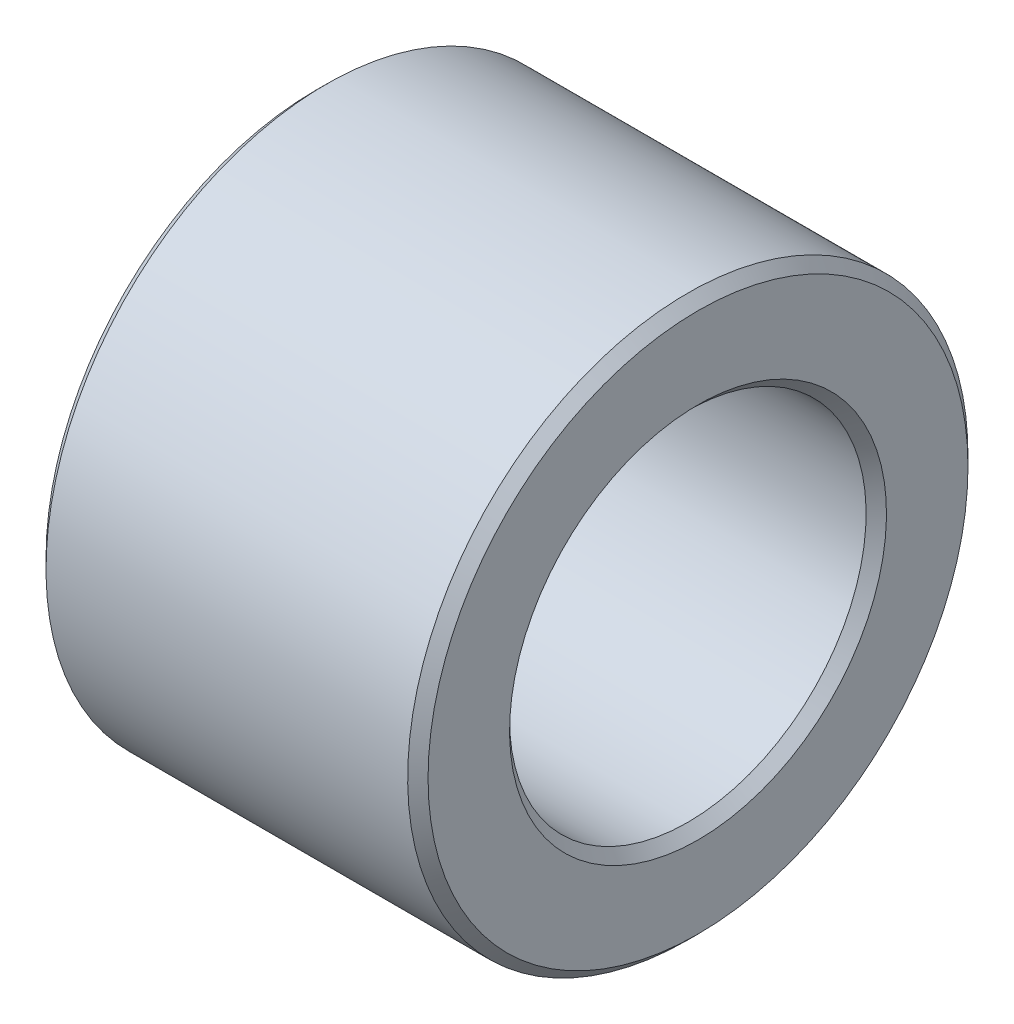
ISO-10303-21;
HEADER;
FILE_DESCRIPTION(('STEP AP214'),'2;1');
FILE_NAME('part.step','',(''),(''),'','','');
FILE_SCHEMA(('AUTOMOTIVE_DESIGN { 1 0 10303 214 1 1 1 1 }'));
ENDSEC;
DATA;
#1=APPLICATION_CONTEXT('core data for automotive mechanical design processes');
#2=APPLICATION_PROTOCOL_DEFINITION('international standard','automotive_design',2000,#1);
#3=PRODUCT_CONTEXT('',#1,'mechanical');
#4=PRODUCT('Part','Part','',(#3));
#5=PRODUCT_RELATED_PRODUCT_CATEGORY('part','',(#4));
#6=PRODUCT_DEFINITION_FORMATION('','',#4);
#7=PRODUCT_DEFINITION_CONTEXT('part definition',#1,'design');
#8=PRODUCT_DEFINITION('design','',#6,#7);
#9=PRODUCT_DEFINITION_SHAPE('','',#8);
#10=(LENGTH_UNIT() NAMED_UNIT(*) SI_UNIT(.MILLI.,.METRE.));
#11=(NAMED_UNIT(*) PLANE_ANGLE_UNIT() SI_UNIT($,.RADIAN.));
#12=(NAMED_UNIT(*) SI_UNIT($,.STERADIAN.) SOLID_ANGLE_UNIT());
#13=UNCERTAINTY_MEASURE_WITH_UNIT(LENGTH_MEASURE(1.E-05),#10,'distance_accuracy_value','');
#14=(GEOMETRIC_REPRESENTATION_CONTEXT(3) GLOBAL_UNCERTAINTY_ASSIGNED_CONTEXT((#13)) GLOBAL_UNIT_ASSIGNED_CONTEXT((#10,
#11,#12)) REPRESENTATION_CONTEXT('',''));
#15=CARTESIAN_POINT('',(0.,0.,0.));
#16=DIRECTION('',(0.,0.,1.));
#17=DIRECTION('',(1.,0.,0.));
#18=AXIS2_PLACEMENT_3D('',#15,#16,#17);
#19=CARTESIAN_POINT('',(0.,-9.,0.));
#20=DIRECTION('',(-1.,0.,0.));
#21=DIRECTION('',(0.,1.,0.));
#22=AXIS2_PLACEMENT_3D('',#19,#20,#21);
#23=PLANE('',#22);
#24=CARTESIAN_POINT('',(0.,0.,0.));
#25=DIRECTION('',(1.,0.,0.));
#26=DIRECTION('',(0.,-1.,0.));
#27=AXIS2_PLACEMENT_3D('',#24,#25,#26);
#28=CIRCLE('',#27,7.4);
#29=CARTESIAN_POINT('',(0.,-7.4,0.));
#30=VERTEX_POINT('',#29);
#31=EDGE_CURVE('E9',#30,#30,#28,.T.);
#32=ORIENTED_EDGE('',*,*,#31,.T.);
#33=EDGE_LOOP('',(#32));
#34=FACE_BOUND('',#33,.T.);
#35=CARTESIAN_POINT('',(0.,0.,0.));
#36=DIRECTION('',(1.,0.,0.));
#37=DIRECTION('',(0.,-1.,0.));
#38=AXIS2_PLACEMENT_3D('',#35,#36,#37);
#39=CIRCLE('',#38,10.6);
#40=CARTESIAN_POINT('',(0.,-10.6,0.));
#41=VERTEX_POINT('',#40);
#42=EDGE_CURVE('E53',#41,#41,#39,.T.);
#43=ORIENTED_EDGE('',*,*,#42,.F.);
#44=EDGE_LOOP('',(#43));
#45=FACE_BOUND('',#44,.T.);
#46=ADVANCED_FACE('F15',(#34,#45),#23,.T.);
#47=CARTESIAN_POINT('',(0.2,0.,0.));
#48=DIRECTION('',(-1.,0.,0.));
#49=DIRECTION('',(0.,-1.,0.));
#50=AXIS2_PLACEMENT_3D('',#47,#48,#49);
#51=CONICAL_SURFACE('',#50,7.2,0.785398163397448);
#52=CARTESIAN_POINT('',(0.4,0.,0.));
#53=DIRECTION('',(1.,0.,0.));
#54=DIRECTION('',(0.,-1.,0.));
#55=AXIS2_PLACEMENT_3D('',#52,#53,#54);
#56=CIRCLE('',#55,7.);
#57=CARTESIAN_POINT('',(0.4,-7.,0.));
#58=VERTEX_POINT('',#57);
#59=EDGE_CURVE('E22',#58,#58,#56,.T.);
#60=ORIENTED_EDGE('',*,*,#59,.T.);
#61=EDGE_LOOP('',(#60));
#62=FACE_BOUND('',#61,.T.);
#63=ORIENTED_EDGE('',*,*,#31,.F.);
#64=EDGE_LOOP('',(#63));
#65=FACE_BOUND('',#64,.T.);
#66=ADVANCED_FACE('F82',(#62,#65),#51,.F.);
#67=CARTESIAN_POINT('',(7.5,0.,0.));
#68=DIRECTION('',(-1.,0.,0.));
#69=DIRECTION('',(0.,-1.,0.));
#70=AXIS2_PLACEMENT_3D('',#67,#68,#69);
#71=CYLINDRICAL_SURFACE('',#70,7.);
#72=CARTESIAN_POINT('',(14.6,0.,0.));
#73=DIRECTION('',(1.,0.,0.));
#74=DIRECTION('',(0.,-1.,0.));
#75=AXIS2_PLACEMENT_3D('',#72,#73,#74);
#76=CIRCLE('',#75,7.);
#77=CARTESIAN_POINT('',(14.6,-7.,0.));
#78=VERTEX_POINT('',#77);
#79=EDGE_CURVE('E58',#78,#78,#76,.T.);
#80=ORIENTED_EDGE('',*,*,#79,.T.);
#81=EDGE_LOOP('',(#80));
#82=FACE_BOUND('',#81,.T.);
#83=ORIENTED_EDGE('',*,*,#59,.F.);
#84=EDGE_LOOP('',(#83));
#85=FACE_BOUND('',#84,.T.);
#86=ADVANCED_FACE('F66',(#82,#85),#71,.F.);
#87=CARTESIAN_POINT('',(14.8,0.,0.));
#88=DIRECTION('',(1.,0.,0.));
#89=DIRECTION('',(0.,-1.,0.));
#90=AXIS2_PLACEMENT_3D('',#87,#88,#89);
#91=CONICAL_SURFACE('',#90,7.2,0.785398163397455);
#92=CARTESIAN_POINT('',(15.,0.,0.));
#93=DIRECTION('',(1.,0.,0.));
#94=DIRECTION('',(0.,-1.,0.));
#95=AXIS2_PLACEMENT_3D('',#92,#93,#94);
#96=CIRCLE('',#95,7.4);
#97=CARTESIAN_POINT('',(15.,-7.4,0.));
#98=VERTEX_POINT('',#97);
#99=EDGE_CURVE('E63',#98,#98,#96,.T.);
#100=ORIENTED_EDGE('',*,*,#99,.T.);
#101=EDGE_LOOP('',(#100));
#102=FACE_BOUND('',#101,.T.);
#103=ORIENTED_EDGE('',*,*,#79,.F.);
#104=EDGE_LOOP('',(#103));
#105=FACE_BOUND('',#104,.T.);
#106=ADVANCED_FACE('F69',(#102,#105),#91,.F.);
#107=CARTESIAN_POINT('',(15.,-9.,0.));
#108=DIRECTION('',(1.,0.,0.));
#109=DIRECTION('',(0.,-1.,0.));
#110=AXIS2_PLACEMENT_3D('',#107,#108,#109);
#111=PLANE('',#110);
#112=CARTESIAN_POINT('',(15.,0.,0.));
#113=DIRECTION('',(1.,0.,0.));
#114=DIRECTION('',(0.,-1.,0.));
#115=AXIS2_PLACEMENT_3D('',#112,#113,#114);
#116=CIRCLE('',#115,10.6);
#117=CARTESIAN_POINT('',(15.,-10.6,0.));
#118=VERTEX_POINT('',#117);
#119=EDGE_CURVE('E61',#118,#118,#116,.T.);
#120=ORIENTED_EDGE('',*,*,#119,.T.);
#121=EDGE_LOOP('',(#120));
#122=FACE_BOUND('',#121,.T.);
#123=ORIENTED_EDGE('',*,*,#99,.F.);
#124=EDGE_LOOP('',(#123));
#125=FACE_BOUND('',#124,.T.);
#126=ADVANCED_FACE('F71',(#122,#125),#111,.T.);
#127=CARTESIAN_POINT('',(14.8,0.,0.));
#128=DIRECTION('',(-1.,0.,0.));
#129=DIRECTION('',(0.,-1.,0.));
#130=AXIS2_PLACEMENT_3D('',#127,#128,#129);
#131=CONICAL_SURFACE('',#130,10.8,0.785398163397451);
#132=CARTESIAN_POINT('',(14.6,0.,0.));
#133=DIRECTION('',(1.,0.,0.));
#134=DIRECTION('',(0.,-1.,0.));
#135=AXIS2_PLACEMENT_3D('',#132,#133,#134);
#136=CIRCLE('',#135,11.);
#137=CARTESIAN_POINT('',(14.6,-11.,0.));
#138=VERTEX_POINT('',#137);
#139=EDGE_CURVE('E55',#138,#138,#136,.T.);
#140=ORIENTED_EDGE('',*,*,#139,.T.);
#141=EDGE_LOOP('',(#140));
#142=FACE_BOUND('',#141,.T.);
#143=ORIENTED_EDGE('',*,*,#119,.F.);
#144=EDGE_LOOP('',(#143));
#145=FACE_BOUND('',#144,.T.);
#146=ADVANCED_FACE('F79',(#142,#145),#131,.T.);
#147=CARTESIAN_POINT('',(7.5,0.,0.));
#148=DIRECTION('',(-1.,0.,0.));
#149=DIRECTION('',(0.,-1.,0.));
#150=AXIS2_PLACEMENT_3D('',#147,#148,#149);
#151=CYLINDRICAL_SURFACE('',#150,11.);
#152=CARTESIAN_POINT('',(0.4,0.,0.));
#153=DIRECTION('',(1.,0.,0.));
#154=DIRECTION('',(0.,-1.,0.));
#155=AXIS2_PLACEMENT_3D('',#152,#153,#154);
#156=CIRCLE('',#155,11.);
#157=CARTESIAN_POINT('',(0.4,-11.,0.));
#158=VERTEX_POINT('',#157);
#159=EDGE_CURVE('E49',#158,#158,#156,.T.);
#160=ORIENTED_EDGE('',*,*,#159,.T.);
#161=EDGE_LOOP('',(#160));
#162=FACE_BOUND('',#161,.T.);
#163=ORIENTED_EDGE('',*,*,#139,.F.);
#164=EDGE_LOOP('',(#163));
#165=FACE_BOUND('',#164,.T.);
#166=ADVANCED_FACE('F50',(#162,#165),#151,.T.);
#167=CARTESIAN_POINT('',(0.2,0.,0.));
#168=DIRECTION('',(1.,0.,0.));
#169=DIRECTION('',(0.,-1.,0.));
#170=AXIS2_PLACEMENT_3D('',#167,#168,#169);
#171=CONICAL_SURFACE('',#170,10.8,0.785398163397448);
#172=ORIENTED_EDGE('',*,*,#42,.T.);
#173=EDGE_LOOP('',(#172));
#174=FACE_BOUND('',#173,.T.);
#175=ORIENTED_EDGE('',*,*,#159,.F.);
#176=EDGE_LOOP('',(#175));
#177=FACE_BOUND('',#176,.T.);
#178=ADVANCED_FACE('F92',(#174,#177),#171,.T.);
#179=CLOSED_SHELL('',(#46,#66,#86,#106,#126,#146,#166,#178));
#180=MANIFOLD_SOLID_BREP('B1',#179);
#181=ADVANCED_BREP_SHAPE_REPRESENTATION('',(#18,#180),#14);
#182=SHAPE_DEFINITION_REPRESENTATION(#9,#181);
ENDSEC;
END-ISO-10303-21;
